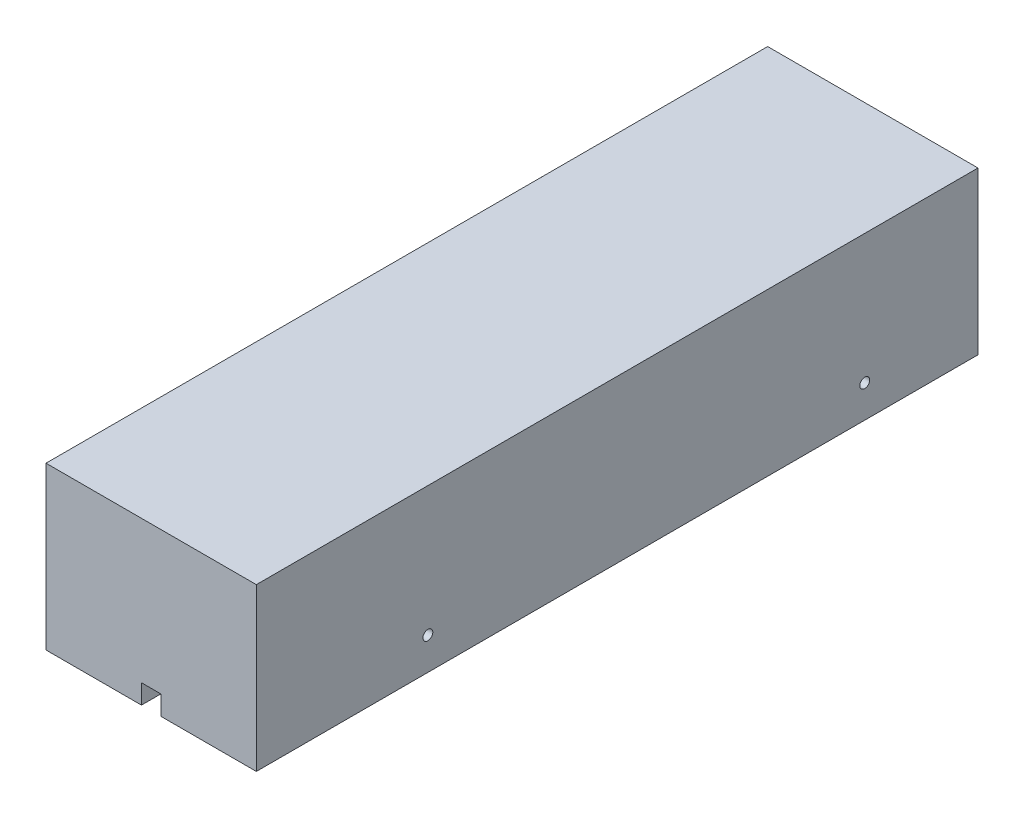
ISO-10303-21;
HEADER;
FILE_DESCRIPTION(('STEP AP214'),'2;1');
FILE_NAME('part.step','',(''),(''),'','','');
FILE_SCHEMA(('AUTOMOTIVE_DESIGN { 1 0 10303 214 1 1 1 1 }'));
ENDSEC;
DATA;
#1=APPLICATION_CONTEXT('core data for automotive mechanical design processes');
#2=APPLICATION_PROTOCOL_DEFINITION('international standard','automotive_design',2000,#1);
#3=PRODUCT_CONTEXT('',#1,'mechanical');
#4=PRODUCT('Part','Part','',(#3));
#5=PRODUCT_RELATED_PRODUCT_CATEGORY('part','',(#4));
#6=PRODUCT_DEFINITION_FORMATION('','',#4);
#7=PRODUCT_DEFINITION_CONTEXT('part definition',#1,'design');
#8=PRODUCT_DEFINITION('design','',#6,#7);
#9=PRODUCT_DEFINITION_SHAPE('','',#8);
#10=(LENGTH_UNIT() NAMED_UNIT(*) SI_UNIT(.MILLI.,.METRE.));
#11=(NAMED_UNIT(*) PLANE_ANGLE_UNIT() SI_UNIT($,.RADIAN.));
#12=(NAMED_UNIT(*) SI_UNIT($,.STERADIAN.) SOLID_ANGLE_UNIT());
#13=UNCERTAINTY_MEASURE_WITH_UNIT(LENGTH_MEASURE(1.E-05),#10,'distance_accuracy_value','');
#14=(GEOMETRIC_REPRESENTATION_CONTEXT(3) GLOBAL_UNCERTAINTY_ASSIGNED_CONTEXT((#13)) GLOBAL_UNIT_ASSIGNED_CONTEXT((#10,
#11,#12)) REPRESENTATION_CONTEXT('',''));
#15=CARTESIAN_POINT('',(0.,0.,0.));
#16=DIRECTION('',(0.,0.,1.));
#17=DIRECTION('',(1.,0.,0.));
#18=AXIS2_PLACEMENT_3D('',#15,#16,#17);
#19=CARTESIAN_POINT('',(-32.5,0.,223.));
#20=DIRECTION('',(0.,1.,0.));
#21=DIRECTION('',(0.,0.,1.));
#22=AXIS2_PLACEMENT_3D('',#19,#20,#21);
#23=PLANE('',#22);
#24=DIRECTION('',(1.,0.,0.));
#25=VECTOR('',#24,1.);
#26=CARTESIAN_POINT('',(-32.5,0.,0.));
#27=LINE('',#26,#25);
#28=CARTESIAN_POINT('',(-32.5,0.,0.));
#29=VERTEX_POINT('',#28);
#30=CARTESIAN_POINT('',(-3.,0.,0.));
#31=VERTEX_POINT('',#30);
#32=EDGE_CURVE('E116',#29,#31,#27,.T.);
#33=ORIENTED_EDGE('',*,*,#32,.T.);
#34=DIRECTION('',(0.,0.,1.));
#35=VECTOR('',#34,1.);
#36=CARTESIAN_POINT('',(-3.,0.,0.));
#37=LINE('',#36,#35);
#38=CARTESIAN_POINT('',(-3.,0.,223.));
#39=VERTEX_POINT('',#38);
#40=EDGE_CURVE('E104',#31,#39,#37,.T.);
#41=ORIENTED_EDGE('',*,*,#40,.T.);
#42=DIRECTION('',(1.,0.,0.));
#43=VECTOR('',#42,1.);
#44=CARTESIAN_POINT('',(-32.5,0.,223.));
#45=LINE('',#44,#43);
#46=CARTESIAN_POINT('',(-32.5,0.,223.));
#47=VERTEX_POINT('',#46);
#48=EDGE_CURVE('E82',#47,#39,#45,.T.);
#49=ORIENTED_EDGE('',*,*,#48,.F.);
#50=DIRECTION('',(0.,0.,-1.));
#51=VECTOR('',#50,1.);
#52=CARTESIAN_POINT('',(-32.5,0.,223.));
#53=LINE('',#52,#51);
#54=EDGE_CURVE('E11',#47,#29,#53,.T.);
#55=ORIENTED_EDGE('',*,*,#54,.T.);
#56=EDGE_LOOP('',(#33,#41,#49,#55));
#57=FACE_BOUND('',#56,.T.);
#58=ADVANCED_FACE('F30',(#57),#23,.F.);
#59=CARTESIAN_POINT('',(-32.5,0.,223.));
#60=DIRECTION('',(1.,0.,0.));
#61=DIRECTION('',(0.,0.,-1.));
#62=AXIS2_PLACEMENT_3D('',#59,#60,#61);
#63=PLANE('',#62);
#64=CARTESIAN_POINT('',(-32.5,10.,35.));
#65=DIRECTION('',(1.,0.,0.));
#66=DIRECTION('',(0.,0.,-1.));
#67=AXIS2_PLACEMENT_3D('',#64,#65,#66);
#68=CIRCLE('',#67,1.525);
#69=CARTESIAN_POINT('',(-32.5,10.,33.475));
#70=VERTEX_POINT('',#69);
#71=EDGE_CURVE('E181',#70,#70,#68,.T.);
#72=ORIENTED_EDGE('',*,*,#71,.T.);
#73=EDGE_LOOP('',(#72));
#74=FACE_BOUND('',#73,.T.);
#75=CARTESIAN_POINT('',(-32.5,10.,170.));
#76=DIRECTION('',(1.,0.,0.));
#77=DIRECTION('',(0.,0.,-1.));
#78=AXIS2_PLACEMENT_3D('',#75,#76,#77);
#79=CIRCLE('',#78,1.52500000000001);
#80=CARTESIAN_POINT('',(-32.5,10.,168.475));
#81=VERTEX_POINT('',#80);
#82=EDGE_CURVE('E176',#81,#81,#79,.T.);
#83=ORIENTED_EDGE('',*,*,#82,.T.);
#84=EDGE_LOOP('',(#83));
#85=FACE_BOUND('',#84,.T.);
#86=DIRECTION('',(0.,-1.,0.));
#87=VECTOR('',#86,1.);
#88=CARTESIAN_POINT('',(-32.5,0.,0.));
#89=LINE('',#88,#87);
#90=CARTESIAN_POINT('',(-32.5,50.,0.));
#91=VERTEX_POINT('',#90);
#92=EDGE_CURVE('E127',#91,#29,#89,.T.);
#93=ORIENTED_EDGE('',*,*,#92,.T.);
#94=ORIENTED_EDGE('',*,*,#54,.F.);
#95=DIRECTION('',(0.,-1.,0.));
#96=VECTOR('',#95,1.);
#97=CARTESIAN_POINT('',(-32.5,0.,223.));
#98=LINE('',#97,#96);
#99=CARTESIAN_POINT('',(-32.5,50.,223.));
#100=VERTEX_POINT('',#99);
#101=EDGE_CURVE('E132',#100,#47,#98,.T.);
#102=ORIENTED_EDGE('',*,*,#101,.F.);
#103=DIRECTION('',(0.,0.,-1.));
#104=VECTOR('',#103,1.);
#105=CARTESIAN_POINT('',(-32.5,50.,223.));
#106=LINE('',#105,#104);
#107=EDGE_CURVE('E133',#100,#91,#106,.T.);
#108=ORIENTED_EDGE('',*,*,#107,.T.);
#109=EDGE_LOOP('',(#93,#94,#102,#108));
#110=FACE_BOUND('',#109,.T.);
#111=ADVANCED_FACE('F32',(#74,#85,#110),#63,.F.);
#112=CARTESIAN_POINT('',(3.,0.,223.));
#113=VERTEX_POINT('',#112);
#114=CARTESIAN_POINT('',(32.5,0.,223.));
#115=VERTEX_POINT('',#114);
#116=EDGE_CURVE('E158',#113,#115,#45,.T.);
#117=ORIENTED_EDGE('',*,*,#116,.F.);
#118=DIRECTION('',(0.,0.,1.));
#119=VECTOR('',#118,1.);
#120=CARTESIAN_POINT('',(3.,0.,0.));
#121=LINE('',#120,#119);
#122=CARTESIAN_POINT('',(3.,0.,0.));
#123=VERTEX_POINT('',#122);
#124=EDGE_CURVE('E111',#123,#113,#121,.T.);
#125=ORIENTED_EDGE('',*,*,#124,.F.);
#126=CARTESIAN_POINT('',(32.5,0.,0.));
#127=VERTEX_POINT('',#126);
#128=EDGE_CURVE('E124',#123,#127,#27,.T.);
#129=ORIENTED_EDGE('',*,*,#128,.T.);
#130=DIRECTION('',(0.,0.,-1.));
#131=VECTOR('',#130,1.);
#132=CARTESIAN_POINT('',(32.5,0.,223.));
#133=LINE('',#132,#131);
#134=EDGE_CURVE('E38',#115,#127,#133,.T.);
#135=ORIENTED_EDGE('',*,*,#134,.F.);
#136=EDGE_LOOP('',(#117,#125,#129,#135));
#137=FACE_BOUND('',#136,.T.);
#138=ADVANCED_FACE('F201',(#137),#23,.F.);
#139=CARTESIAN_POINT('',(32.5,0.,223.));
#140=DIRECTION('',(-1.,0.,0.));
#141=DIRECTION('',(0.,0.,1.));
#142=AXIS2_PLACEMENT_3D('',#139,#140,#141);
#143=PLANE('',#142);
#144=CARTESIAN_POINT('',(32.5,10.,35.));
#145=DIRECTION('',(1.,0.,0.));
#146=DIRECTION('',(0.,0.,-1.));
#147=AXIS2_PLACEMENT_3D('',#144,#145,#146);
#148=CIRCLE('',#147,1.525);
#149=CARTESIAN_POINT('',(32.5,10.,33.475));
#150=VERTEX_POINT('',#149);
#151=EDGE_CURVE('E184',#150,#150,#148,.T.);
#152=ORIENTED_EDGE('',*,*,#151,.F.);
#153=EDGE_LOOP('',(#152));
#154=FACE_BOUND('',#153,.T.);
#155=CARTESIAN_POINT('',(32.5,10.,170.));
#156=DIRECTION('',(1.,0.,0.));
#157=DIRECTION('',(0.,0.,-1.));
#158=AXIS2_PLACEMENT_3D('',#155,#156,#157);
#159=CIRCLE('',#158,1.52500000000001);
#160=CARTESIAN_POINT('',(32.5,10.,168.475));
#161=VERTEX_POINT('',#160);
#162=EDGE_CURVE('E178',#161,#161,#159,.T.);
#163=ORIENTED_EDGE('',*,*,#162,.F.);
#164=EDGE_LOOP('',(#163));
#165=FACE_BOUND('',#164,.T.);
#166=DIRECTION('',(0.,1.,0.));
#167=VECTOR('',#166,1.);
#168=CARTESIAN_POINT('',(32.5,0.,0.));
#169=LINE('',#168,#167);
#170=CARTESIAN_POINT('',(32.5,50.,0.));
#171=VERTEX_POINT('',#170);
#172=EDGE_CURVE('E123',#127,#171,#169,.T.);
#173=ORIENTED_EDGE('',*,*,#172,.T.);
#174=DIRECTION('',(0.,0.,-1.));
#175=VECTOR('',#174,1.);
#176=CARTESIAN_POINT('',(32.5,50.,223.));
#177=LINE('',#176,#175);
#178=CARTESIAN_POINT('',(32.5,50.,223.));
#179=VERTEX_POINT('',#178);
#180=EDGE_CURVE('E135',#179,#171,#177,.T.);
#181=ORIENTED_EDGE('',*,*,#180,.F.);
#182=DIRECTION('',(0.,1.,0.));
#183=VECTOR('',#182,1.);
#184=CARTESIAN_POINT('',(32.5,0.,223.));
#185=LINE('',#184,#183);
#186=EDGE_CURVE('E143',#115,#179,#185,.T.);
#187=ORIENTED_EDGE('',*,*,#186,.F.);
#188=ORIENTED_EDGE('',*,*,#134,.T.);
#189=EDGE_LOOP('',(#173,#181,#187,#188));
#190=FACE_BOUND('',#189,.T.);
#191=ADVANCED_FACE('F141',(#154,#165,#190),#143,.F.);
#192=CARTESIAN_POINT('',(-32.5,50.,223.));
#193=DIRECTION('',(0.,-1.,0.));
#194=DIRECTION('',(0.,0.,-1.));
#195=AXIS2_PLACEMENT_3D('',#192,#193,#194);
#196=PLANE('',#195);
#197=DIRECTION('',(-1.,0.,0.));
#198=VECTOR('',#197,1.);
#199=CARTESIAN_POINT('',(-32.5,50.,0.));
#200=LINE('',#199,#198);
#201=EDGE_CURVE('E75',#171,#91,#200,.T.);
#202=ORIENTED_EDGE('',*,*,#201,.T.);
#203=ORIENTED_EDGE('',*,*,#107,.F.);
#204=DIRECTION('',(-1.,0.,0.));
#205=VECTOR('',#204,1.);
#206=CARTESIAN_POINT('',(-32.5,50.,223.));
#207=LINE('',#206,#205);
#208=EDGE_CURVE('E54',#179,#100,#207,.T.);
#209=ORIENTED_EDGE('',*,*,#208,.F.);
#210=ORIENTED_EDGE('',*,*,#180,.T.);
#211=EDGE_LOOP('',(#202,#203,#209,#210));
#212=FACE_BOUND('',#211,.T.);
#213=ADVANCED_FACE('F162',(#212),#196,.F.);
#214=CARTESIAN_POINT('',(-32.5,50.,223.));
#215=DIRECTION('',(0.,0.,-1.));
#216=DIRECTION('',(-1.,0.,0.));
#217=AXIS2_PLACEMENT_3D('',#214,#215,#216);
#218=PLANE('',#217);
#219=ORIENTED_EDGE('',*,*,#48,.T.);
#220=DIRECTION('',(0.,-1.,0.));
#221=VECTOR('',#220,1.);
#222=CARTESIAN_POINT('',(-3.,0.,223.));
#223=LINE('',#222,#221);
#224=CARTESIAN_POINT('',(-3.,6.,223.));
#225=VERTEX_POINT('',#224);
#226=EDGE_CURVE('E109',#225,#39,#223,.T.);
#227=ORIENTED_EDGE('',*,*,#226,.F.);
#228=DIRECTION('',(-1.,0.,0.));
#229=VECTOR('',#228,1.);
#230=CARTESIAN_POINT('',(-3.,6.,223.));
#231=LINE('',#230,#229);
#232=CARTESIAN_POINT('',(3.,6.,223.));
#233=VERTEX_POINT('',#232);
#234=EDGE_CURVE('E119',#233,#225,#231,.T.);
#235=ORIENTED_EDGE('',*,*,#234,.F.);
#236=DIRECTION('',(0.,1.,0.));
#237=VECTOR('',#236,1.);
#238=CARTESIAN_POINT('',(3.,0.,223.));
#239=LINE('',#238,#237);
#240=EDGE_CURVE('E165',#113,#233,#239,.T.);
#241=ORIENTED_EDGE('',*,*,#240,.F.);
#242=ORIENTED_EDGE('',*,*,#116,.T.);
#243=ORIENTED_EDGE('',*,*,#186,.T.);
#244=ORIENTED_EDGE('',*,*,#208,.T.);
#245=ORIENTED_EDGE('',*,*,#101,.T.);
#246=EDGE_LOOP('',(#219,#227,#235,#241,#242,#243,#244,#245));
#247=FACE_BOUND('',#246,.T.);
#248=ADVANCED_FACE('F160',(#247),#218,.F.);
#249=CARTESIAN_POINT('',(-32.5,50.,0.));
#250=DIRECTION('',(0.,0.,-1.));
#251=DIRECTION('',(-1.,0.,0.));
#252=AXIS2_PLACEMENT_3D('',#249,#250,#251);
#253=PLANE('',#252);
#254=CARTESIAN_POINT('',(0.,29.,0.));
#255=DIRECTION('',(0.,0.,-1.));
#256=DIRECTION('',(-1.,0.,0.));
#257=AXIS2_PLACEMENT_3D('',#254,#255,#256);
#258=CIRCLE('',#257,9.55);
#259=CARTESIAN_POINT('',(-9.55,29.,0.));
#260=VERTEX_POINT('',#259);
#261=EDGE_CURVE('E170',#260,#260,#258,.T.);
#262=ORIENTED_EDGE('',*,*,#261,.F.);
#263=EDGE_LOOP('',(#262));
#264=FACE_BOUND('',#263,.T.);
#265=DIRECTION('',(0.,-1.,0.));
#266=VECTOR('',#265,1.);
#267=CARTESIAN_POINT('',(-3.,0.,0.));
#268=LINE('',#267,#266);
#269=CARTESIAN_POINT('',(-3.,6.,0.));
#270=VERTEX_POINT('',#269);
#271=EDGE_CURVE('E107',#270,#31,#268,.T.);
#272=ORIENTED_EDGE('',*,*,#271,.T.);
#273=ORIENTED_EDGE('',*,*,#32,.F.);
#274=ORIENTED_EDGE('',*,*,#92,.F.);
#275=ORIENTED_EDGE('',*,*,#201,.F.);
#276=ORIENTED_EDGE('',*,*,#172,.F.);
#277=ORIENTED_EDGE('',*,*,#128,.F.);
#278=DIRECTION('',(0.,1.,0.));
#279=VECTOR('',#278,1.);
#280=CARTESIAN_POINT('',(3.,0.,0.));
#281=LINE('',#280,#279);
#282=CARTESIAN_POINT('',(3.,6.,0.));
#283=VERTEX_POINT('',#282);
#284=EDGE_CURVE('E118',#123,#283,#281,.T.);
#285=ORIENTED_EDGE('',*,*,#284,.T.);
#286=DIRECTION('',(-1.,0.,0.));
#287=VECTOR('',#286,1.);
#288=CARTESIAN_POINT('',(-3.,6.,0.));
#289=LINE('',#288,#287);
#290=EDGE_CURVE('E45',#283,#270,#289,.T.);
#291=ORIENTED_EDGE('',*,*,#290,.T.);
#292=EDGE_LOOP('',(#272,#273,#274,#275,#276,#277,#285,#291));
#293=FACE_BOUND('',#292,.T.);
#294=ADVANCED_FACE('F114',(#264,#293),#253,.T.);
#295=CARTESIAN_POINT('',(-3.,0.,0.));
#296=DIRECTION('',(-1.,0.,0.));
#297=DIRECTION('',(0.,0.,1.));
#298=AXIS2_PLACEMENT_3D('',#295,#296,#297);
#299=PLANE('',#298);
#300=ORIENTED_EDGE('',*,*,#226,.T.);
#301=ORIENTED_EDGE('',*,*,#40,.F.);
#302=ORIENTED_EDGE('',*,*,#271,.F.);
#303=DIRECTION('',(0.,0.,1.));
#304=VECTOR('',#303,1.);
#305=CARTESIAN_POINT('',(-3.,6.,0.));
#306=LINE('',#305,#304);
#307=EDGE_CURVE('E148',#270,#225,#306,.T.);
#308=ORIENTED_EDGE('',*,*,#307,.T.);
#309=EDGE_LOOP('',(#300,#301,#302,#308));
#310=FACE_BOUND('',#309,.T.);
#311=ADVANCED_FACE('F106',(#310),#299,.F.);
#312=CARTESIAN_POINT('',(-3.,6.,0.));
#313=DIRECTION('',(0.,1.,0.));
#314=DIRECTION('',(0.,0.,1.));
#315=AXIS2_PLACEMENT_3D('',#312,#313,#314);
#316=PLANE('',#315);
#317=ORIENTED_EDGE('',*,*,#234,.T.);
#318=ORIENTED_EDGE('',*,*,#307,.F.);
#319=ORIENTED_EDGE('',*,*,#290,.F.);
#320=DIRECTION('',(0.,0.,1.));
#321=VECTOR('',#320,1.);
#322=CARTESIAN_POINT('',(3.,6.,0.));
#323=LINE('',#322,#321);
#324=EDGE_CURVE('E149',#283,#233,#323,.T.);
#325=ORIENTED_EDGE('',*,*,#324,.T.);
#326=EDGE_LOOP('',(#317,#318,#319,#325));
#327=FACE_BOUND('',#326,.T.);
#328=ADVANCED_FACE('F226',(#327),#316,.F.);
#329=CARTESIAN_POINT('',(3.,0.,0.));
#330=DIRECTION('',(1.,0.,0.));
#331=DIRECTION('',(0.,1.,0.));
#332=AXIS2_PLACEMENT_3D('',#329,#330,#331);
#333=PLANE('',#332);
#334=ORIENTED_EDGE('',*,*,#240,.T.);
#335=ORIENTED_EDGE('',*,*,#324,.F.);
#336=ORIENTED_EDGE('',*,*,#284,.F.);
#337=ORIENTED_EDGE('',*,*,#124,.T.);
#338=EDGE_LOOP('',(#334,#335,#336,#337));
#339=FACE_BOUND('',#338,.T.);
#340=ADVANCED_FACE('F225',(#339),#333,.F.);
#341=CARTESIAN_POINT('',(0.,29.,52.));
#342=DIRECTION('',(0.,0.,-1.));
#343=DIRECTION('',(-1.,0.,0.));
#344=AXIS2_PLACEMENT_3D('',#341,#342,#343);
#345=CYLINDRICAL_SURFACE('',#344,9.55);
#346=CARTESIAN_POINT('',(0.,29.,52.));
#347=DIRECTION('',(0.,0.,-1.));
#348=DIRECTION('',(-1.,0.,0.));
#349=AXIS2_PLACEMENT_3D('',#346,#347,#348);
#350=CIRCLE('',#349,9.55);
#351=CARTESIAN_POINT('',(-9.55,29.,52.));
#352=VERTEX_POINT('',#351);
#353=EDGE_CURVE('E166',#352,#352,#350,.T.);
#354=CARTESIAN_POINT('',(-9.55,29.,52.));
#355=CARTESIAN_POINT('',(-9.55,29.,51.4583333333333));
#356=CARTESIAN_POINT('',(-9.55,29.,50.9166666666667));
#357=CARTESIAN_POINT('',(-9.55,29.,49.8333333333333));
#358=CARTESIAN_POINT('',(-9.55,29.,49.2916666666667));
#359=CARTESIAN_POINT('',(-9.55,29.,48.2083333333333));
#360=CARTESIAN_POINT('',(-9.55,29.,47.6666666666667));
#361=CARTESIAN_POINT('',(-9.55,29.,46.5833333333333));
#362=CARTESIAN_POINT('',(-9.55,29.,46.0416666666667));
#363=CARTESIAN_POINT('',(-9.55,29.,44.9583333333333));
#364=CARTESIAN_POINT('',(-9.55,29.,44.4166666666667));
#365=CARTESIAN_POINT('',(-9.55,29.,43.3333333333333));
#366=CARTESIAN_POINT('',(-9.55,29.,42.7916666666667));
#367=CARTESIAN_POINT('',(-9.55,29.,41.7083333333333));
#368=CARTESIAN_POINT('',(-9.55,29.,41.1666666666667));
#369=CARTESIAN_POINT('',(-9.55,29.,40.0833333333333));
#370=CARTESIAN_POINT('',(-9.55,29.,39.5416666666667));
#371=CARTESIAN_POINT('',(-9.55,29.,38.4583333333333));
#372=CARTESIAN_POINT('',(-9.55,29.,37.9166666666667));
#373=CARTESIAN_POINT('',(-9.55,29.,36.8333333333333));
#374=CARTESIAN_POINT('',(-9.55,29.,36.2916666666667));
#375=CARTESIAN_POINT('',(-9.55,29.,35.2083333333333));
#376=CARTESIAN_POINT('',(-9.55,29.,34.6666666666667));
#377=CARTESIAN_POINT('',(-9.55,29.,33.5833333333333));
#378=CARTESIAN_POINT('',(-9.55,29.,33.0416666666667));
#379=CARTESIAN_POINT('',(-9.55,29.,31.9583333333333));
#380=CARTESIAN_POINT('',(-9.55,29.,31.4166666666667));
#381=CARTESIAN_POINT('',(-9.55,29.,30.3333333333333));
#382=CARTESIAN_POINT('',(-9.55,29.,29.7916666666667));
#383=CARTESIAN_POINT('',(-9.55,29.,28.7083333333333));
#384=CARTESIAN_POINT('',(-9.55,29.,28.1666666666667));
#385=CARTESIAN_POINT('',(-9.55,29.,27.0833333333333));
#386=CARTESIAN_POINT('',(-9.55,29.,26.5416666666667));
#387=CARTESIAN_POINT('',(-9.55,29.,25.4583333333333));
#388=CARTESIAN_POINT('',(-9.55,29.,24.9166666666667));
#389=CARTESIAN_POINT('',(-9.55,29.,23.8333333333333));
#390=CARTESIAN_POINT('',(-9.55,29.,23.2916666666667));
#391=CARTESIAN_POINT('',(-9.55,29.,22.2083333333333));
#392=CARTESIAN_POINT('',(-9.55,29.,21.6666666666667));
#393=CARTESIAN_POINT('',(-9.55,29.,20.5833333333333));
#394=CARTESIAN_POINT('',(-9.55,29.,20.0416666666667));
#395=CARTESIAN_POINT('',(-9.55,29.,18.9583333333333));
#396=CARTESIAN_POINT('',(-9.55,29.,18.4166666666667));
#397=CARTESIAN_POINT('',(-9.55,29.,17.3333333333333));
#398=CARTESIAN_POINT('',(-9.55,29.,16.7916666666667));
#399=CARTESIAN_POINT('',(-9.55,29.,15.7083333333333));
#400=CARTESIAN_POINT('',(-9.55,29.,15.1666666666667));
#401=CARTESIAN_POINT('',(-9.55,29.,14.0833333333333));
#402=CARTESIAN_POINT('',(-9.55,29.,13.5416666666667));
#403=CARTESIAN_POINT('',(-9.55,29.,12.4583333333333));
#404=CARTESIAN_POINT('',(-9.55,29.,11.9166666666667));
#405=CARTESIAN_POINT('',(-9.55,29.,10.8333333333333));
#406=CARTESIAN_POINT('',(-9.55,29.,10.2916666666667));
#407=CARTESIAN_POINT('',(-9.55,29.,9.20833333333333));
#408=CARTESIAN_POINT('',(-9.55,29.,8.66666666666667));
#409=CARTESIAN_POINT('',(-9.55,29.,7.58333333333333));
#410=CARTESIAN_POINT('',(-9.55,29.,7.04166666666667));
#411=CARTESIAN_POINT('',(-9.55,29.,5.95833333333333));
#412=CARTESIAN_POINT('',(-9.55,29.,5.41666666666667));
#413=CARTESIAN_POINT('',(-9.55,29.,4.33333333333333));
#414=CARTESIAN_POINT('',(-9.55,29.,3.79166666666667));
#415=CARTESIAN_POINT('',(-9.55,29.,2.70833333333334));
#416=CARTESIAN_POINT('',(-9.55,29.,2.16666666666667));
#417=CARTESIAN_POINT('',(-9.55,29.,1.08333333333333));
#418=CARTESIAN_POINT('',(-9.55,29.,0.541666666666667));
#419=CARTESIAN_POINT('',(-9.55,29.,0.));
#420=B_SPLINE_CURVE_WITH_KNOTS('',3,(#354,#355,#356,#357,#358,#359,#360,#361,#362,#363,#364,
#365,#366,#367,#368,#369,#370,#371,#372,#373,#374,#375,#376,#377,#378,#379,#380,#381,#382,#383,
#384,#385,#386,#387,#388,#389,#390,#391,#392,#393,#394,#395,#396,#397,#398,#399,#400,#401,#402,
#403,#404,#405,#406,#407,#408,#409,#410,#411,#412,#413,#414,#415,#416,#417,#418,#419),
.UNSPECIFIED.,.F.,.F.,(4,2,2,2,2,2,2,2,2,2,2,2,2,2,2,2,2,2,2,2,2,2,2,2,2,2,2,2,2,2,2,2,4),(0.,
1.62499999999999,3.25,4.875,6.5,8.12499999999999,9.74999999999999,11.375,13.,14.625,16.25,
17.875,19.5,21.125,22.75,24.375,26.,27.625,29.25,30.875,32.5,34.125,35.75,37.375,39.,40.625,
42.25,43.875,45.5,47.125,48.75,50.375,52.),.UNSPECIFIED.);
#421=EDGE_CURVE('BSEAM212',#352,#260,#420,.T.);
#422=ORIENTED_EDGE('',*,*,#353,.F.);
#423=ORIENTED_EDGE('',*,*,#261,.T.);
#424=ORIENTED_EDGE('',*,*,#421,.T.);
#425=ORIENTED_EDGE('',*,*,#421,.F.);
#426=EDGE_LOOP('',(#422,#424,#423,#425));
#427=FACE_BOUND('',#426,.T.);
#428=ADVANCED_FACE('F212',(#427),#345,.F.);
#429=CARTESIAN_POINT('',(0.,29.,52.));
#430=DIRECTION('',(0.,0.,-1.));
#431=DIRECTION('',(-1.,0.,0.));
#432=AXIS2_PLACEMENT_3D('',#429,#430,#431);
#433=PLANE('',#432);
#434=ORIENTED_EDGE('',*,*,#353,.T.);
#435=EDGE_LOOP('',(#434));
#436=FACE_BOUND('',#435,.T.);
#437=ADVANCED_FACE('F206',(#436),#433,.T.);
#438=CARTESIAN_POINT('',(-32.5,10.,170.));
#439=DIRECTION('',(1.,0.,0.));
#440=DIRECTION('',(0.,0.,-1.));
#441=AXIS2_PLACEMENT_3D('',#438,#439,#440);
#442=CYLINDRICAL_SURFACE('',#441,1.52500000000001);
#443=ORIENTED_EDGE('',*,*,#82,.F.);
#444=EDGE_LOOP('',(#443));
#445=FACE_BOUND('',#444,.T.);
#446=ORIENTED_EDGE('',*,*,#162,.T.);
#447=EDGE_LOOP('',(#446));
#448=FACE_BOUND('',#447,.T.);
#449=ADVANCED_FACE('F195',(#445,#448),#442,.F.);
#450=CARTESIAN_POINT('',(-32.5,10.,35.));
#451=DIRECTION('',(1.,0.,0.));
#452=DIRECTION('',(0.,0.,-1.));
#453=AXIS2_PLACEMENT_3D('',#450,#451,#452);
#454=CYLINDRICAL_SURFACE('',#453,1.525);
#455=ORIENTED_EDGE('',*,*,#71,.F.);
#456=EDGE_LOOP('',(#455));
#457=FACE_BOUND('',#456,.T.);
#458=ORIENTED_EDGE('',*,*,#151,.T.);
#459=EDGE_LOOP('',(#458));
#460=FACE_BOUND('',#459,.T.);
#461=ADVANCED_FACE('F192',(#457,#460),#454,.F.);
#462=CLOSED_SHELL('',(#58,#111,#138,#191,#213,#248,#294,#311,#328,#340,#428,#437,#449,#461));
#463=MANIFOLD_SOLID_BREP('B2',#462);
#464=ADVANCED_BREP_SHAPE_REPRESENTATION('',(#18,#463),#14);
#465=SHAPE_DEFINITION_REPRESENTATION(#9,#464);
ENDSEC;
END-ISO-10303-21;
